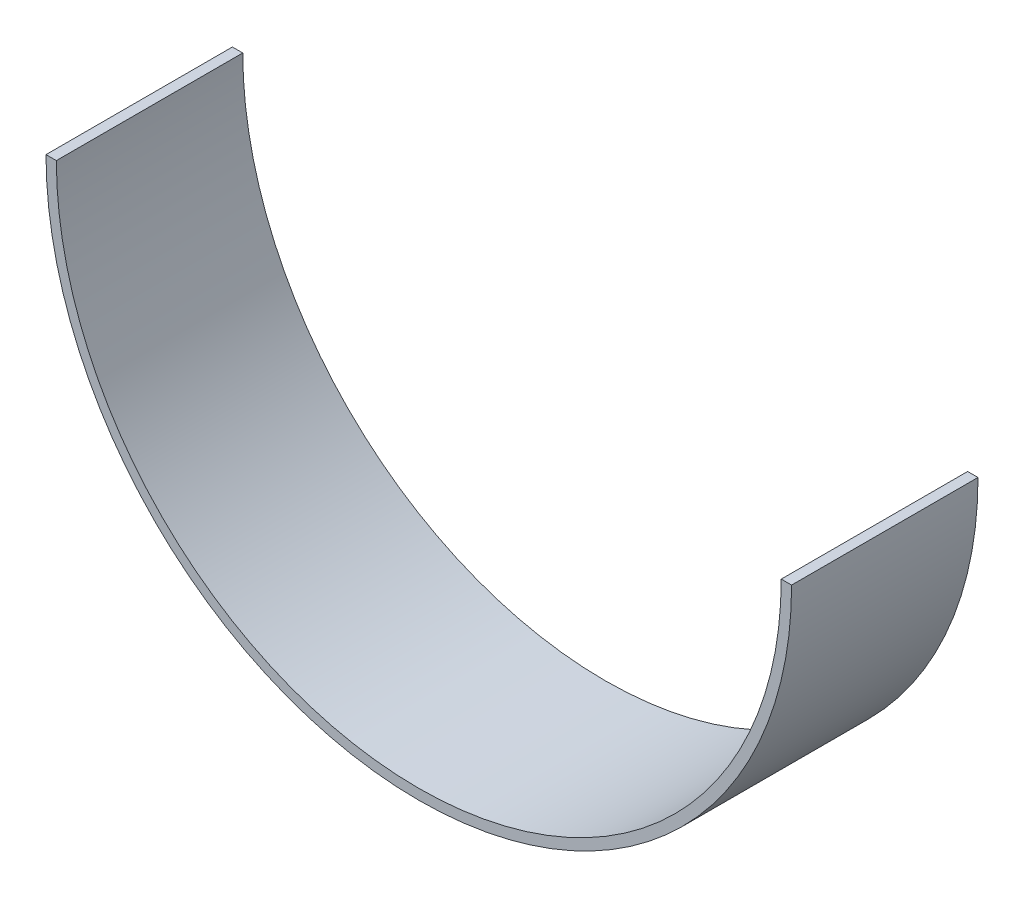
ISO-10303-21;
HEADER;
FILE_DESCRIPTION(('STEP AP214'),'2;1');
FILE_NAME('part.step','',(''),(''),'','','');
FILE_SCHEMA(('AUTOMOTIVE_DESIGN { 1 0 10303 214 1 1 1 1 }'));
ENDSEC;
DATA;
#1=APPLICATION_CONTEXT('core data for automotive mechanical design processes');
#2=APPLICATION_PROTOCOL_DEFINITION('international standard','automotive_design',2000,#1);
#3=PRODUCT_CONTEXT('',#1,'mechanical');
#4=PRODUCT('Part','Part','',(#3));
#5=PRODUCT_RELATED_PRODUCT_CATEGORY('part','',(#4));
#6=PRODUCT_DEFINITION_FORMATION('','',#4);
#7=PRODUCT_DEFINITION_CONTEXT('part definition',#1,'design');
#8=PRODUCT_DEFINITION('design','',#6,#7);
#9=PRODUCT_DEFINITION_SHAPE('','',#8);
#10=(LENGTH_UNIT() NAMED_UNIT(*) SI_UNIT(.MILLI.,.METRE.));
#11=(NAMED_UNIT(*) PLANE_ANGLE_UNIT() SI_UNIT($,.RADIAN.));
#12=(NAMED_UNIT(*) SI_UNIT($,.STERADIAN.) SOLID_ANGLE_UNIT());
#13=UNCERTAINTY_MEASURE_WITH_UNIT(LENGTH_MEASURE(1.E-05),#10,'distance_accuracy_value','');
#14=(GEOMETRIC_REPRESENTATION_CONTEXT(3) GLOBAL_UNCERTAINTY_ASSIGNED_CONTEXT((#13)) GLOBAL_UNIT_ASSIGNED_CONTEXT((#10,
#11,#12)) REPRESENTATION_CONTEXT('',''));
#15=CARTESIAN_POINT('',(0.,0.,0.));
#16=DIRECTION('',(0.,0.,1.));
#17=DIRECTION('',(1.,0.,0.));
#18=AXIS2_PLACEMENT_3D('',#15,#16,#17);
#19=CARTESIAN_POINT('',(114.3,0.,57.15));
#20=DIRECTION('',(0.,0.,-1.));
#21=DIRECTION('',(-1.,0.,0.));
#22=AXIS2_PLACEMENT_3D('',#19,#20,#21);
#23=CYLINDRICAL_SURFACE('',#22,114.3);
#24=CARTESIAN_POINT('',(114.3,0.,0.));
#25=DIRECTION('',(0.,0.,1.));
#26=DIRECTION('',(1.,0.,0.));
#27=AXIS2_PLACEMENT_3D('',#24,#25,#26);
#28=CIRCLE('',#27,114.3);
#29=CARTESIAN_POINT('',(0.,0.,0.));
#30=VERTEX_POINT('',#29);
#31=CARTESIAN_POINT('',(228.6,0.,0.));
#32=VERTEX_POINT('',#31);
#33=EDGE_CURVE('E94',#30,#32,#28,.T.);
#34=ORIENTED_EDGE('',*,*,#33,.T.);
#35=DIRECTION('',(0.,0.,-1.));
#36=VECTOR('',#35,1.);
#37=CARTESIAN_POINT('',(228.6,0.,57.15));
#38=LINE('',#37,#36);
#39=CARTESIAN_POINT('',(228.6,0.,57.15));
#40=VERTEX_POINT('',#39);
#41=EDGE_CURVE('E11',#40,#32,#38,.T.);
#42=ORIENTED_EDGE('',*,*,#41,.F.);
#43=CARTESIAN_POINT('',(114.3,0.,57.15));
#44=DIRECTION('',(0.,0.,1.));
#45=DIRECTION('',(1.,0.,0.));
#46=AXIS2_PLACEMENT_3D('',#43,#44,#45);
#47=CIRCLE('',#46,114.3);
#48=CARTESIAN_POINT('',(0.,0.,57.15));
#49=VERTEX_POINT('',#48);
#50=EDGE_CURVE('E82',#49,#40,#47,.T.);
#51=ORIENTED_EDGE('',*,*,#50,.F.);
#52=DIRECTION('',(0.,0.,-1.));
#53=VECTOR('',#52,1.);
#54=CARTESIAN_POINT('',(0.,0.,57.15));
#55=LINE('',#54,#53);
#56=EDGE_CURVE('E90',#49,#30,#55,.T.);
#57=ORIENTED_EDGE('',*,*,#56,.T.);
#58=EDGE_LOOP('',(#34,#42,#51,#57));
#59=FACE_BOUND('',#58,.T.);
#60=ADVANCED_FACE('F31',(#59),#23,.T.);
#61=CARTESIAN_POINT('',(228.6,0.,57.15));
#62=DIRECTION('',(0.,-1.,0.));
#63=DIRECTION('',(0.,0.,-1.));
#64=AXIS2_PLACEMENT_3D('',#61,#62,#63);
#65=PLANE('',#64);
#66=DIRECTION('',(-1.,0.,0.));
#67=VECTOR('',#66,1.);
#68=CARTESIAN_POINT('',(228.6,0.,0.));
#69=LINE('',#68,#67);
#70=CARTESIAN_POINT('',(225.425,0.,0.));
#71=VERTEX_POINT('',#70);
#72=EDGE_CURVE('E86',#32,#71,#69,.T.);
#73=ORIENTED_EDGE('',*,*,#72,.T.);
#74=DIRECTION('',(0.,0.,-1.));
#75=VECTOR('',#74,1.);
#76=CARTESIAN_POINT('',(225.425,0.,57.15));
#77=LINE('',#76,#75);
#78=CARTESIAN_POINT('',(225.425,0.,57.15));
#79=VERTEX_POINT('',#78);
#80=EDGE_CURVE('E39',#79,#71,#77,.T.);
#81=ORIENTED_EDGE('',*,*,#80,.F.);
#82=DIRECTION('',(-1.,0.,0.));
#83=VECTOR('',#82,1.);
#84=CARTESIAN_POINT('',(228.6,0.,57.15));
#85=LINE('',#84,#83);
#86=EDGE_CURVE('E77',#40,#79,#85,.T.);
#87=ORIENTED_EDGE('',*,*,#86,.F.);
#88=ORIENTED_EDGE('',*,*,#41,.T.);
#89=EDGE_LOOP('',(#73,#81,#87,#88));
#90=FACE_BOUND('',#89,.T.);
#91=ADVANCED_FACE('F85',(#90),#65,.F.);
#92=CARTESIAN_POINT('',(114.3,0.,57.15));
#93=DIRECTION('',(0.,0.,-1.));
#94=DIRECTION('',(-1.,0.,0.));
#95=AXIS2_PLACEMENT_3D('',#92,#93,#94);
#96=CYLINDRICAL_SURFACE('',#95,111.125);
#97=CARTESIAN_POINT('',(114.3,0.,0.));
#98=DIRECTION('',(0.,0.,-1.));
#99=DIRECTION('',(1.,0.,0.));
#100=AXIS2_PLACEMENT_3D('',#97,#98,#99);
#101=CIRCLE('',#100,111.125);
#102=CARTESIAN_POINT('',(3.175,0.,0.));
#103=VERTEX_POINT('',#102);
#104=EDGE_CURVE('E64',#71,#103,#101,.T.);
#105=ORIENTED_EDGE('',*,*,#104,.T.);
#106=DIRECTION('',(0.,0.,-1.));
#107=VECTOR('',#106,1.);
#108=CARTESIAN_POINT('',(3.175,0.,57.15));
#109=LINE('',#108,#107);
#110=CARTESIAN_POINT('',(3.175,0.,57.15));
#111=VERTEX_POINT('',#110);
#112=EDGE_CURVE('E87',#111,#103,#109,.T.);
#113=ORIENTED_EDGE('',*,*,#112,.F.);
#114=CARTESIAN_POINT('',(114.3,0.,57.15));
#115=DIRECTION('',(0.,0.,-1.));
#116=DIRECTION('',(1.,0.,0.));
#117=AXIS2_PLACEMENT_3D('',#114,#115,#116);
#118=CIRCLE('',#117,111.125);
#119=EDGE_CURVE('E80',#79,#111,#118,.T.);
#120=ORIENTED_EDGE('',*,*,#119,.F.);
#121=ORIENTED_EDGE('',*,*,#80,.T.);
#122=EDGE_LOOP('',(#105,#113,#120,#121));
#123=FACE_BOUND('',#122,.T.);
#124=ADVANCED_FACE('F88',(#123),#96,.F.);
#125=CARTESIAN_POINT('',(0.,0.,57.15));
#126=DIRECTION('',(0.,-1.,0.));
#127=DIRECTION('',(0.,0.,-1.));
#128=AXIS2_PLACEMENT_3D('',#125,#126,#127);
#129=PLANE('',#128);
#130=DIRECTION('',(-1.,0.,0.));
#131=VECTOR('',#130,1.);
#132=CARTESIAN_POINT('',(0.,0.,0.));
#133=LINE('',#132,#131);
#134=EDGE_CURVE('E70',#103,#30,#133,.T.);
#135=ORIENTED_EDGE('',*,*,#134,.T.);
#136=ORIENTED_EDGE('',*,*,#56,.F.);
#137=DIRECTION('',(-1.,0.,0.));
#138=VECTOR('',#137,1.);
#139=CARTESIAN_POINT('',(0.,0.,57.15));
#140=LINE('',#139,#138);
#141=EDGE_CURVE('E47',#111,#49,#140,.T.);
#142=ORIENTED_EDGE('',*,*,#141,.F.);
#143=ORIENTED_EDGE('',*,*,#112,.T.);
#144=EDGE_LOOP('',(#135,#136,#142,#143));
#145=FACE_BOUND('',#144,.T.);
#146=ADVANCED_FACE('F101',(#145),#129,.F.);
#147=CARTESIAN_POINT('',(114.3,0.,57.15));
#148=DIRECTION('',(0.,0.,1.));
#149=DIRECTION('',(1.,0.,0.));
#150=AXIS2_PLACEMENT_3D('',#147,#148,#149);
#151=PLANE('',#150);
#152=ORIENTED_EDGE('',*,*,#50,.T.);
#153=ORIENTED_EDGE('',*,*,#86,.T.);
#154=ORIENTED_EDGE('',*,*,#119,.T.);
#155=ORIENTED_EDGE('',*,*,#141,.T.);
#156=EDGE_LOOP('',(#152,#153,#154,#155));
#157=FACE_BOUND('',#156,.T.);
#158=ADVANCED_FACE('F78',(#157),#151,.T.);
#159=CARTESIAN_POINT('',(114.3,0.,0.));
#160=DIRECTION('',(0.,0.,1.));
#161=DIRECTION('',(1.,0.,0.));
#162=AXIS2_PLACEMENT_3D('',#159,#160,#161);
#163=PLANE('',#162);
#164=ORIENTED_EDGE('',*,*,#33,.F.);
#165=ORIENTED_EDGE('',*,*,#134,.F.);
#166=ORIENTED_EDGE('',*,*,#104,.F.);
#167=ORIENTED_EDGE('',*,*,#72,.F.);
#168=EDGE_LOOP('',(#164,#165,#166,#167));
#169=FACE_BOUND('',#168,.T.);
#170=ADVANCED_FACE('F104',(#169),#163,.F.);
#171=CLOSED_SHELL('',(#60,#91,#124,#146,#158,#170));
#172=MANIFOLD_SOLID_BREP('B2',#171);
#173=ADVANCED_BREP_SHAPE_REPRESENTATION('',(#18,#172),#14);
#174=SHAPE_DEFINITION_REPRESENTATION(#9,#173);
ENDSEC;
END-ISO-10303-21;
